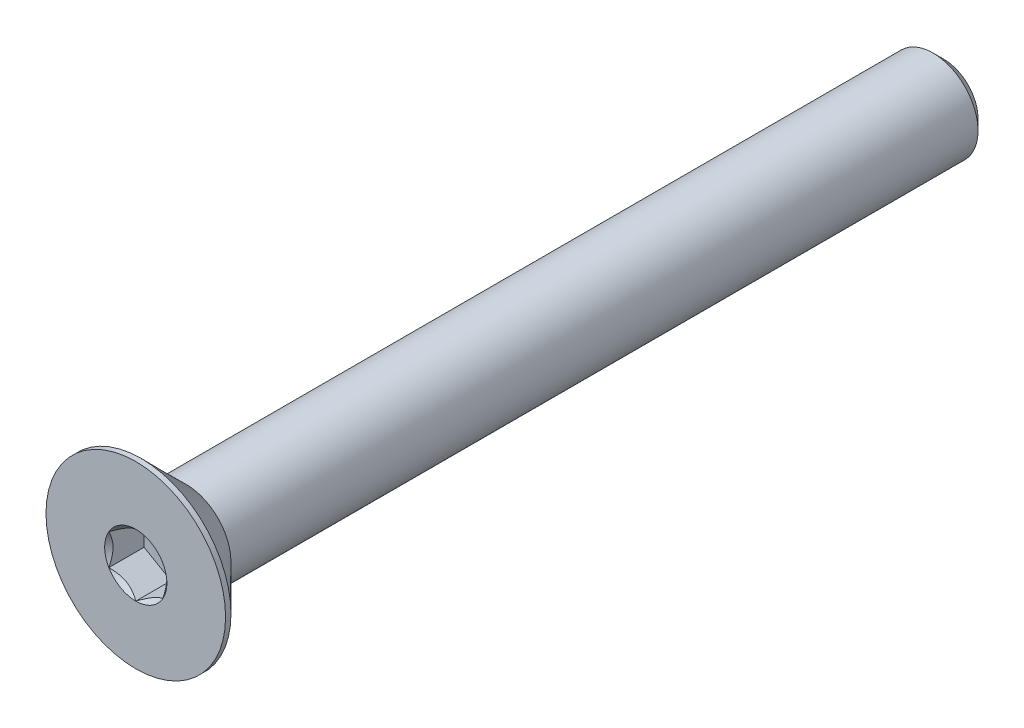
from build123d import *

# Parameters (mm, degrees)
SKETCH1_W          = 45
SKETCH1_H          = 2.5
CHAMFER1_SIZE      = 0.6
CUT_EXTRUDE2_DEPTH = 1.96


with BuildPart() as part:
    # Sketch1 → Revolve1 (revolve)
    with BuildSketch(Plane(origin=(0, 0, 0), x_dir=(0, 0, -1), z_dir=(1, 0, 0))):
        with Locations((22.5, 1.25)):
            Rectangle(SKETCH1_W, SKETCH1_H)
    revolve(axis=Axis((0, 0, -45), (0, 0, 1)))

    # Chamfer1
    chamfer1_edges = [part.edges().sort_by_distance(p)[0] for p in [
        (0, -2.5, -45),
    ]]
    chamfer(chamfer1_edges, length=CHAMFER1_SIZE)

    # Sketch7 → Revolve2 (revolve)
    with BuildSketch(Plane(origin=(0, 0, 0), x_dir=(0, 0, -1), z_dir=(1, 0, 0)), mode=Mode.PRIVATE) as revolve2_sk:
        Polygon((0, 5), (0.3, 5), (2.8, 2.5), (2.8, 0), (0, 0), align=None)
    revolve(revolve2_sk.sketch.rotate(Axis((0, 0, 0), (0, 0, -1)), 180), axis=Axis((0, 0, 0), (0, 0, -1)))

    # Boss-Extrude1 cone 1 section (on through the dimple's axis) → Boss-Extrude1 (revolve)
    with BuildSketch(Plane(origin=(0, 0, -2.8), x_dir=(0, -1, 0), z_dir=(1, 0, 0))):
        Polygon((0, 0), (2.5, 0), (0, 2.5), align=None)
    revolve(axis=Axis((0, 0, -2.8), (0, 0, -1)))

    # Sketch5 → Cut-Extrude2 (cut)
    with BuildSketch(Plane.XY):
        Polygon((1.5, -0.866025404), (1.5, 0.866025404), (0, 1.732050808), (-1.5, 0.866025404), (-1.5, -0.866025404), (0, -1.732050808), align=None)
    extrude(amount=-CUT_EXTRUDE2_DEPTH, mode=Mode.SUBTRACT)

    # Cut-Extrude3 cone 1 section (on through the dimple's axis) → Cut-Extrude3 (revolve, cut)
    with BuildSketch(Plane(origin=(0, 0, 0), x_dir=(0, -1, 0), z_dir=(1, 0, 0))):
        Polygon((0, 0), (1.732050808, 0), (0, 1.732050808), align=None)
    revolve(axis=Axis((0, 0, 0), (0, 0, -1)), mode=Mode.SUBTRACT)


solid = part.part
